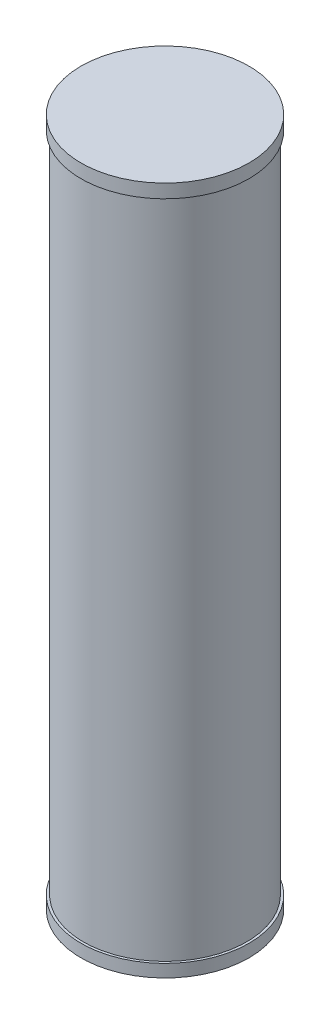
ISO-10303-21;
HEADER;
FILE_DESCRIPTION(('STEP AP214'),'2;1');
FILE_NAME('part.step','',(''),(''),'','','');
FILE_SCHEMA(('AUTOMOTIVE_DESIGN { 1 0 10303 214 1 1 1 1 }'));
ENDSEC;
DATA;
#1=APPLICATION_CONTEXT('core data for automotive mechanical design processes');
#2=APPLICATION_PROTOCOL_DEFINITION('international standard','automotive_design',2000,#1);
#3=PRODUCT_CONTEXT('',#1,'mechanical');
#4=PRODUCT('Part','Part','',(#3));
#5=PRODUCT_RELATED_PRODUCT_CATEGORY('part','',(#4));
#6=PRODUCT_DEFINITION_FORMATION('','',#4);
#7=PRODUCT_DEFINITION_CONTEXT('part definition',#1,'design');
#8=PRODUCT_DEFINITION('design','',#6,#7);
#9=PRODUCT_DEFINITION_SHAPE('','',#8);
#10=(LENGTH_UNIT() NAMED_UNIT(*) SI_UNIT(.MILLI.,.METRE.));
#11=(NAMED_UNIT(*) PLANE_ANGLE_UNIT() SI_UNIT($,.RADIAN.));
#12=(NAMED_UNIT(*) SI_UNIT($,.STERADIAN.) SOLID_ANGLE_UNIT());
#13=UNCERTAINTY_MEASURE_WITH_UNIT(LENGTH_MEASURE(1.E-05),#10,'distance_accuracy_value','');
#14=(GEOMETRIC_REPRESENTATION_CONTEXT(3) GLOBAL_UNCERTAINTY_ASSIGNED_CONTEXT((#13)) GLOBAL_UNIT_ASSIGNED_CONTEXT((#10,
#11,#12)) REPRESENTATION_CONTEXT('',''));
#15=CARTESIAN_POINT('',(0.,0.,0.));
#16=DIRECTION('',(0.,0.,1.));
#17=DIRECTION('',(1.,0.,0.));
#18=AXIS2_PLACEMENT_3D('',#15,#16,#17);
#19=CARTESIAN_POINT('',(1.07552855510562E-13,-15.9947327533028,0.));
#20=DIRECTION('',(0.,1.,0.));
#21=DIRECTION('',(-1.,0.,0.));
#22=AXIS2_PLACEMENT_3D('',#19,#20,#21);
#23=CYLINDRICAL_SURFACE('',#22,109.537499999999);
#24=CARTESIAN_POINT('',(0.,862.33,0.));
#25=DIRECTION('',(0.,1.,0.));
#26=DIRECTION('',(-1.,0.,0.));
#27=AXIS2_PLACEMENT_3D('',#24,#25,#26);
#28=CIRCLE('',#27,109.537499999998);
#29=CARTESIAN_POINT('',(-109.537499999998,862.33,0.));
#30=VERTEX_POINT('',#29);
#31=EDGE_CURVE('E53',#30,#30,#28,.T.);
#32=ORIENTED_EDGE('',*,*,#31,.T.);
#33=EDGE_LOOP('',(#32));
#34=FACE_BOUND('',#33,.T.);
#35=CARTESIAN_POINT('',(0.,880.11,0.));
#36=DIRECTION('',(0.,1.,0.));
#37=DIRECTION('',(-1.,0.,0.));
#38=AXIS2_PLACEMENT_3D('',#35,#36,#37);
#39=CIRCLE('',#38,109.5375);
#40=CARTESIAN_POINT('',(-109.5375,880.11,0.));
#41=VERTEX_POINT('',#40);
#42=EDGE_CURVE('E10',#41,#41,#39,.T.);
#43=ORIENTED_EDGE('',*,*,#42,.F.);
#44=EDGE_LOOP('',(#43));
#45=FACE_BOUND('',#44,.T.);
#46=ADVANCED_FACE('F31',(#34,#45),#23,.T.);
#47=CARTESIAN_POINT('',(-109.5375,880.11,0.));
#48=DIRECTION('',(0.,1.,0.));
#49=DIRECTION('',(-1.,0.,0.));
#50=AXIS2_PLACEMENT_3D('',#47,#48,#49);
#51=PLANE('',#50);
#52=ORIENTED_EDGE('',*,*,#42,.T.);
#53=EDGE_LOOP('',(#52));
#54=FACE_BOUND('',#53,.T.);
#55=ADVANCED_FACE('F71',(#54),#51,.T.);
#56=CARTESIAN_POINT('',(-109.537499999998,-17.7800000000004,0.));
#57=DIRECTION('',(0.,-1.,0.));
#58=DIRECTION('',(1.,0.,0.));
#59=AXIS2_PLACEMENT_3D('',#56,#57,#58);
#60=PLANE('',#59);
#61=CARTESIAN_POINT('',(1.07763466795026E-13,-17.7800000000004,0.));
#62=DIRECTION('',(0.,1.,0.));
#63=DIRECTION('',(-1.,0.,0.));
#64=AXIS2_PLACEMENT_3D('',#61,#62,#63);
#65=CIRCLE('',#64,109.537499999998);
#66=CARTESIAN_POINT('',(-109.537499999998,-17.7800000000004,0.));
#67=VERTEX_POINT('',#66);
#68=EDGE_CURVE('E37',#67,#67,#65,.T.);
#69=ORIENTED_EDGE('',*,*,#68,.F.);
#70=EDGE_LOOP('',(#69));
#71=FACE_BOUND('',#70,.T.);
#72=ADVANCED_FACE('F75',(#71),#60,.T.);
#73=CARTESIAN_POINT('',(1.07552855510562E-13,-15.9947327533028,0.));
#74=DIRECTION('',(0.,1.,0.));
#75=DIRECTION('',(-1.,0.,0.));
#76=AXIS2_PLACEMENT_3D('',#73,#74,#75);
#77=CYLINDRICAL_SURFACE('',#76,109.537499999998);
#78=ORIENTED_EDGE('',*,*,#68,.T.);
#79=EDGE_LOOP('',(#78));
#80=FACE_BOUND('',#79,.T.);
#81=CARTESIAN_POINT('',(1.05815751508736E-13,-1.27000000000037,0.));
#82=DIRECTION('',(0.,1.,0.));
#83=DIRECTION('',(-1.,0.,0.));
#84=AXIS2_PLACEMENT_3D('',#81,#82,#83);
#85=CIRCLE('',#84,109.537499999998);
#86=CARTESIAN_POINT('',(-109.537499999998,-1.27000000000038,0.));
#87=VERTEX_POINT('',#86);
#88=EDGE_CURVE('E41',#87,#87,#85,.T.);
#89=ORIENTED_EDGE('',*,*,#88,.F.);
#90=EDGE_LOOP('',(#89));
#91=FACE_BOUND('',#90,.T.);
#92=ADVANCED_FACE('F79',(#80,#91),#77,.T.);
#93=CARTESIAN_POINT('',(-106.4387,-1.27000000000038,0.));
#94=DIRECTION('',(0.,1.,0.));
#95=DIRECTION('',(-1.,0.,0.));
#96=AXIS2_PLACEMENT_3D('',#93,#94,#95);
#97=PLANE('',#96);
#98=ORIENTED_EDGE('',*,*,#88,.T.);
#99=EDGE_LOOP('',(#98));
#100=FACE_BOUND('',#99,.T.);
#101=CARTESIAN_POINT('',(1.05815751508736E-13,-1.27000000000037,0.));
#102=DIRECTION('',(0.,1.,0.));
#103=DIRECTION('',(-1.,0.,0.));
#104=AXIS2_PLACEMENT_3D('',#101,#102,#103);
#105=CIRCLE('',#104,106.4387);
#106=CARTESIAN_POINT('',(-106.4387,-1.27000000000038,0.));
#107=VERTEX_POINT('',#106);
#108=EDGE_CURVE('E45',#107,#107,#105,.T.);
#109=ORIENTED_EDGE('',*,*,#108,.F.);
#110=EDGE_LOOP('',(#109));
#111=FACE_BOUND('',#110,.T.);
#112=ADVANCED_FACE('F67',(#100,#111),#97,.T.);
#113=CARTESIAN_POINT('',(1.07552855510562E-13,-15.9947327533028,0.));
#114=DIRECTION('',(0.,1.,0.));
#115=DIRECTION('',(-1.,0.,0.));
#116=AXIS2_PLACEMENT_3D('',#113,#114,#115);
#117=CYLINDRICAL_SURFACE('',#116,106.4387);
#118=ORIENTED_EDGE('',*,*,#108,.T.);
#119=EDGE_LOOP('',(#118));
#120=FACE_BOUND('',#119,.T.);
#121=CARTESIAN_POINT('',(0.,862.33,0.));
#122=DIRECTION('',(0.,1.,0.));
#123=DIRECTION('',(-1.,0.,0.));
#124=AXIS2_PLACEMENT_3D('',#121,#122,#123);
#125=CIRCLE('',#124,106.4387);
#126=CARTESIAN_POINT('',(-106.4387,862.33,0.));
#127=VERTEX_POINT('',#126);
#128=EDGE_CURVE('E50',#127,#127,#125,.T.);
#129=ORIENTED_EDGE('',*,*,#128,.F.);
#130=EDGE_LOOP('',(#129));
#131=FACE_BOUND('',#130,.T.);
#132=ADVANCED_FACE('F61',(#120,#131),#117,.T.);
#133=CARTESIAN_POINT('',(-106.4387,862.33,0.));
#134=DIRECTION('',(0.,-1.,0.));
#135=DIRECTION('',(1.,0.,0.));
#136=AXIS2_PLACEMENT_3D('',#133,#134,#135);
#137=PLANE('',#136);
#138=ORIENTED_EDGE('',*,*,#128,.T.);
#139=EDGE_LOOP('',(#138));
#140=FACE_BOUND('',#139,.T.);
#141=ORIENTED_EDGE('',*,*,#31,.F.);
#142=EDGE_LOOP('',(#141));
#143=FACE_BOUND('',#142,.T.);
#144=ADVANCED_FACE('F59',(#140,#143),#137,.T.);
#145=CLOSED_SHELL('',(#46,#55,#72,#92,#112,#132,#144));
#146=MANIFOLD_SOLID_BREP('B2',#145);
#147=ADVANCED_BREP_SHAPE_REPRESENTATION('',(#18,#146),#14);
#148=SHAPE_DEFINITION_REPRESENTATION(#9,#147);
ENDSEC;
END-ISO-10303-21;
